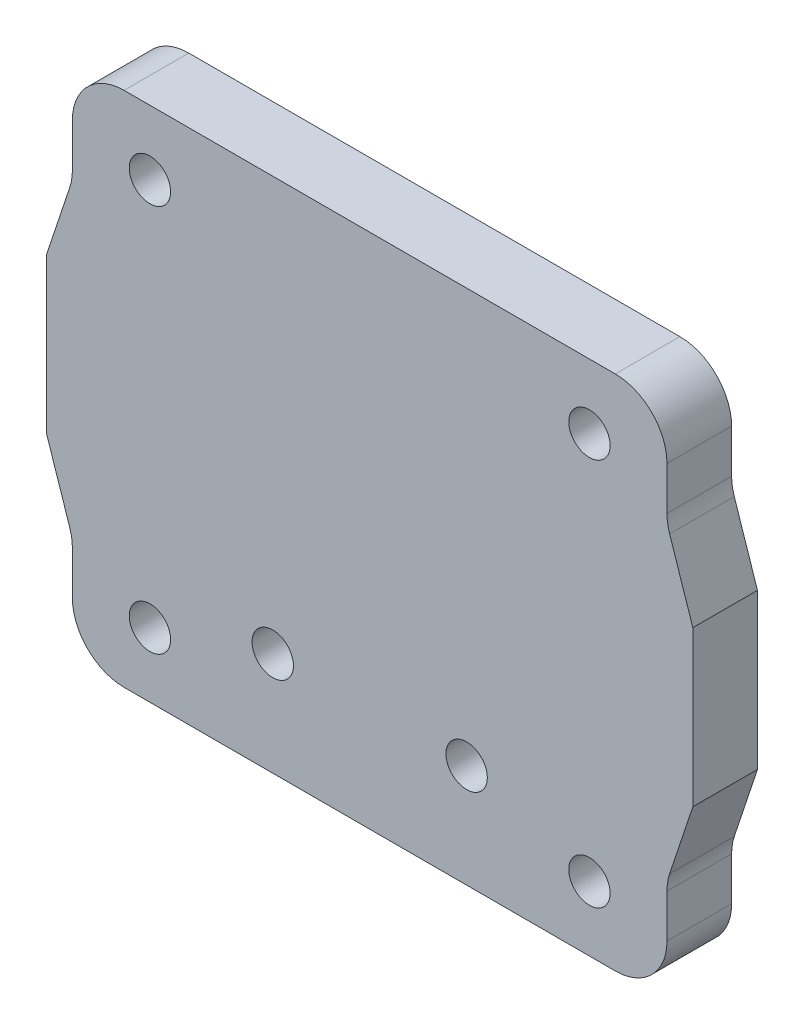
ISO-10303-21;
HEADER;
FILE_DESCRIPTION(('STEP AP214'),'2;1');
FILE_NAME('part.step','',(''),(''),'','','');
FILE_SCHEMA(('AUTOMOTIVE_DESIGN { 1 0 10303 214 1 1 1 1 }'));
ENDSEC;
DATA;
#1=APPLICATION_CONTEXT('core data for automotive mechanical design processes');
#2=APPLICATION_PROTOCOL_DEFINITION('international standard','automotive_design',2000,#1);
#3=PRODUCT_CONTEXT('',#1,'mechanical');
#4=PRODUCT('Part','Part','',(#3));
#5=PRODUCT_RELATED_PRODUCT_CATEGORY('part','',(#4));
#6=PRODUCT_DEFINITION_FORMATION('','',#4);
#7=PRODUCT_DEFINITION_CONTEXT('part definition',#1,'design');
#8=PRODUCT_DEFINITION('design','',#6,#7);
#9=PRODUCT_DEFINITION_SHAPE('','',#8);
#10=(LENGTH_UNIT() NAMED_UNIT(*) SI_UNIT(.MILLI.,.METRE.));
#11=(NAMED_UNIT(*) PLANE_ANGLE_UNIT() SI_UNIT($,.RADIAN.));
#12=(NAMED_UNIT(*) SI_UNIT($,.STERADIAN.) SOLID_ANGLE_UNIT());
#13=UNCERTAINTY_MEASURE_WITH_UNIT(LENGTH_MEASURE(1.E-05),#10,'distance_accuracy_value','');
#14=(GEOMETRIC_REPRESENTATION_CONTEXT(3) GLOBAL_UNCERTAINTY_ASSIGNED_CONTEXT((#13)) GLOBAL_UNIT_ASSIGNED_CONTEXT((#10,
#11,#12)) REPRESENTATION_CONTEXT('',''));
#15=CARTESIAN_POINT('',(0.,0.,0.));
#16=DIRECTION('',(0.,0.,1.));
#17=DIRECTION('',(1.,0.,0.));
#18=AXIS2_PLACEMENT_3D('',#15,#16,#17);
#19=CARTESIAN_POINT('',(-23.,20.,5.));
#20=DIRECTION('',(1.,0.,0.));
#21=DIRECTION('',(0.,1.,0.));
#22=AXIS2_PLACEMENT_3D('',#19,#20,#21);
#23=PLANE('',#22);
#24=DIRECTION('',(0.,-1.,0.));
#25=VECTOR('',#24,1.);
#26=CARTESIAN_POINT('',(-23.,20.,0.));
#27=LINE('',#26,#25);
#28=CARTESIAN_POINT('',(-23.,-12.6491106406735,0.));
#29=VERTEX_POINT('',#28);
#30=CARTESIAN_POINT('',(-23.,-16.,0.));
#31=VERTEX_POINT('',#30);
#32=EDGE_CURVE('E249',#29,#31,#27,.T.);
#33=ORIENTED_EDGE('',*,*,#32,.T.);
#34=DIRECTION('',(0.,0.,-1.));
#35=VECTOR('',#34,1.);
#36=CARTESIAN_POINT('',(-23.,-16.,5.));
#37=LINE('',#36,#35);
#38=CARTESIAN_POINT('',(-23.,-16.,5.));
#39=VERTEX_POINT('',#38);
#40=EDGE_CURVE('E290',#31,#39,#37,.F.);
#41=ORIENTED_EDGE('',*,*,#40,.T.);
#42=DIRECTION('',(0.,-1.,0.));
#43=VECTOR('',#42,1.);
#44=CARTESIAN_POINT('',(-23.,20.,5.));
#45=LINE('',#44,#43);
#46=CARTESIAN_POINT('',(-23.,-12.6491106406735,5.));
#47=VERTEX_POINT('',#46);
#48=EDGE_CURVE('E237',#47,#39,#45,.T.);
#49=ORIENTED_EDGE('',*,*,#48,.F.);
#50=DIRECTION('',(0.,0.,1.));
#51=VECTOR('',#50,1.);
#52=CARTESIAN_POINT('',(-23.,-12.6491106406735,5.));
#53=LINE('',#52,#51);
#54=EDGE_CURVE('E288',#47,#29,#53,.F.);
#55=ORIENTED_EDGE('',*,*,#54,.T.);
#56=EDGE_LOOP('',(#33,#41,#49,#55));
#57=FACE_BOUND('',#56,.T.);
#58=ADVANCED_FACE('F33',(#57),#23,.F.);
#59=CARTESIAN_POINT('',(23.,20.,5.));
#60=DIRECTION('',(-1.,0.,0.));
#61=DIRECTION('',(0.,-1.,0.));
#62=AXIS2_PLACEMENT_3D('',#59,#60,#61);
#63=PLANE('',#62);
#64=DIRECTION('',(0.,1.,0.));
#65=VECTOR('',#64,1.);
#66=CARTESIAN_POINT('',(23.,20.,0.));
#67=LINE('',#66,#65);
#68=CARTESIAN_POINT('',(23.,12.6491106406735,0.));
#69=VERTEX_POINT('',#68);
#70=CARTESIAN_POINT('',(23.,16.,0.));
#71=VERTEX_POINT('',#70);
#72=EDGE_CURVE('E227',#69,#71,#67,.T.);
#73=ORIENTED_EDGE('',*,*,#72,.T.);
#74=DIRECTION('',(0.,0.,-1.));
#75=VECTOR('',#74,1.);
#76=CARTESIAN_POINT('',(23.,16.,5.));
#77=LINE('',#76,#75);
#78=CARTESIAN_POINT('',(23.,16.,5.));
#79=VERTEX_POINT('',#78);
#80=EDGE_CURVE('E269',#71,#79,#77,.F.);
#81=ORIENTED_EDGE('',*,*,#80,.T.);
#82=DIRECTION('',(0.,1.,0.));
#83=VECTOR('',#82,1.);
#84=CARTESIAN_POINT('',(23.,20.,5.));
#85=LINE('',#84,#83);
#86=CARTESIAN_POINT('',(23.,12.6491106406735,5.));
#87=VERTEX_POINT('',#86);
#88=EDGE_CURVE('E234',#87,#79,#85,.T.);
#89=ORIENTED_EDGE('',*,*,#88,.F.);
#90=DIRECTION('',(0.,0.,1.));
#91=VECTOR('',#90,1.);
#92=CARTESIAN_POINT('',(23.,12.6491106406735,5.));
#93=LINE('',#92,#91);
#94=EDGE_CURVE('E267',#87,#69,#93,.F.);
#95=ORIENTED_EDGE('',*,*,#94,.T.);
#96=EDGE_LOOP('',(#73,#81,#89,#95));
#97=FACE_BOUND('',#96,.T.);
#98=ADVANCED_FACE('F356',(#97),#63,.F.);
#99=CARTESIAN_POINT('',(23.,-16.,5.));
#100=VERTEX_POINT('',#99);
#101=CARTESIAN_POINT('',(23.,-12.6491106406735,5.));
#102=VERTEX_POINT('',#101);
#103=EDGE_CURVE('E230',#100,#102,#85,.T.);
#104=ORIENTED_EDGE('',*,*,#103,.F.);
#105=DIRECTION('',(0.,0.,-1.));
#106=VECTOR('',#105,1.);
#107=CARTESIAN_POINT('',(23.,-16.,5.));
#108=LINE('',#107,#106);
#109=CARTESIAN_POINT('',(23.,-16.,0.));
#110=VERTEX_POINT('',#109);
#111=EDGE_CURVE('E295',#100,#110,#108,.T.);
#112=ORIENTED_EDGE('',*,*,#111,.T.);
#113=CARTESIAN_POINT('',(23.,-12.6491106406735,0.));
#114=VERTEX_POINT('',#113);
#115=EDGE_CURVE('E245',#110,#114,#67,.T.);
#116=ORIENTED_EDGE('',*,*,#115,.T.);
#117=DIRECTION('',(0.,0.,1.));
#118=VECTOR('',#117,1.);
#119=CARTESIAN_POINT('',(23.,-12.6491106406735,5.));
#120=LINE('',#119,#118);
#121=EDGE_CURVE('E292',#114,#102,#120,.T.);
#122=ORIENTED_EDGE('',*,*,#121,.T.);
#123=EDGE_LOOP('',(#104,#112,#116,#122));
#124=FACE_BOUND('',#123,.T.);
#125=ADVANCED_FACE('F382',(#124),#63,.F.);
#126=CARTESIAN_POINT('',(-23.,20.,5.));
#127=DIRECTION('',(0.,-1.,0.));
#128=DIRECTION('',(0.,0.,-1.));
#129=AXIS2_PLACEMENT_3D('',#126,#127,#128);
#130=PLANE('',#129);
#131=DIRECTION('',(-1.,0.,0.));
#132=VECTOR('',#131,1.);
#133=CARTESIAN_POINT('',(-23.,20.,5.));
#134=LINE('',#133,#132);
#135=CARTESIAN_POINT('',(19.,20.,5.));
#136=VERTEX_POINT('',#135);
#137=CARTESIAN_POINT('',(-19.,20.,5.));
#138=VERTEX_POINT('',#137);
#139=EDGE_CURVE('E233',#136,#138,#134,.T.);
#140=ORIENTED_EDGE('',*,*,#139,.F.);
#141=DIRECTION('',(0.,0.,-1.));
#142=VECTOR('',#141,1.);
#143=CARTESIAN_POINT('',(19.,20.,5.));
#144=LINE('',#143,#142);
#145=CARTESIAN_POINT('',(19.,20.,0.));
#146=VERTEX_POINT('',#145);
#147=EDGE_CURVE('E256',#136,#146,#144,.T.);
#148=ORIENTED_EDGE('',*,*,#147,.T.);
#149=DIRECTION('',(-1.,0.,0.));
#150=VECTOR('',#149,1.);
#151=CARTESIAN_POINT('',(-23.,20.,0.));
#152=LINE('',#151,#150);
#153=CARTESIAN_POINT('',(-19.,20.,0.));
#154=VERTEX_POINT('',#153);
#155=EDGE_CURVE('E246',#146,#154,#152,.T.);
#156=ORIENTED_EDGE('',*,*,#155,.T.);
#157=DIRECTION('',(0.,0.,-1.));
#158=VECTOR('',#157,1.);
#159=CARTESIAN_POINT('',(-19.,20.,5.));
#160=LINE('',#159,#158);
#161=EDGE_CURVE('E242',#154,#138,#160,.F.);
#162=ORIENTED_EDGE('',*,*,#161,.T.);
#163=EDGE_LOOP('',(#140,#148,#156,#162));
#164=FACE_BOUND('',#163,.T.);
#165=ADVANCED_FACE('F347',(#164),#130,.F.);
#166=CARTESIAN_POINT('',(-23.,16.,5.));
#167=VERTEX_POINT('',#166);
#168=CARTESIAN_POINT('',(-23.,12.6491106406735,5.));
#169=VERTEX_POINT('',#168);
#170=EDGE_CURVE('E239',#167,#169,#45,.T.);
#171=ORIENTED_EDGE('',*,*,#170,.F.);
#172=DIRECTION('',(0.,0.,-1.));
#173=VECTOR('',#172,1.);
#174=CARTESIAN_POINT('',(-23.,16.,5.));
#175=LINE('',#174,#173);
#176=CARTESIAN_POINT('',(-23.,16.,0.));
#177=VERTEX_POINT('',#176);
#178=EDGE_CURVE('E281',#167,#177,#175,.T.);
#179=ORIENTED_EDGE('',*,*,#178,.T.);
#180=CARTESIAN_POINT('',(-23.,12.6491106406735,0.));
#181=VERTEX_POINT('',#180);
#182=EDGE_CURVE('E250',#177,#181,#27,.T.);
#183=ORIENTED_EDGE('',*,*,#182,.T.);
#184=DIRECTION('',(0.,0.,1.));
#185=VECTOR('',#184,1.);
#186=CARTESIAN_POINT('',(-23.,12.6491106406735,5.));
#187=LINE('',#186,#185);
#188=EDGE_CURVE('E278',#181,#169,#187,.T.);
#189=ORIENTED_EDGE('',*,*,#188,.T.);
#190=EDGE_LOOP('',(#171,#179,#183,#189));
#191=FACE_BOUND('',#190,.T.);
#192=ADVANCED_FACE('F339',(#191),#23,.F.);
#193=CARTESIAN_POINT('',(-23.,-20.,5.));
#194=DIRECTION('',(0.,1.,0.));
#195=DIRECTION('',(0.,0.,1.));
#196=AXIS2_PLACEMENT_3D('',#193,#194,#195);
#197=PLANE('',#196);
#198=DIRECTION('',(1.,0.,0.));
#199=VECTOR('',#198,1.);
#200=CARTESIAN_POINT('',(-23.,-20.,5.));
#201=LINE('',#200,#199);
#202=CARTESIAN_POINT('',(-19.,-20.,5.));
#203=VERTEX_POINT('',#202);
#204=CARTESIAN_POINT('',(19.,-20.,5.));
#205=VERTEX_POINT('',#204);
#206=EDGE_CURVE('E240',#203,#205,#201,.T.);
#207=ORIENTED_EDGE('',*,*,#206,.F.);
#208=DIRECTION('',(0.,0.,-1.));
#209=VECTOR('',#208,1.);
#210=CARTESIAN_POINT('',(-19.,-20.,5.));
#211=LINE('',#210,#209);
#212=CARTESIAN_POINT('',(-19.,-20.,0.));
#213=VERTEX_POINT('',#212);
#214=EDGE_CURVE('E285',#203,#213,#211,.T.);
#215=ORIENTED_EDGE('',*,*,#214,.T.);
#216=DIRECTION('',(1.,0.,0.));
#217=VECTOR('',#216,1.);
#218=CARTESIAN_POINT('',(-23.,-20.,0.));
#219=LINE('',#218,#217);
#220=CARTESIAN_POINT('',(19.,-20.,0.));
#221=VERTEX_POINT('',#220);
#222=EDGE_CURVE('E253',#213,#221,#219,.T.);
#223=ORIENTED_EDGE('',*,*,#222,.T.);
#224=DIRECTION('',(0.,0.,-1.));
#225=VECTOR('',#224,1.);
#226=CARTESIAN_POINT('',(19.,-20.,5.));
#227=LINE('',#226,#225);
#228=EDGE_CURVE('E48',#221,#205,#227,.F.);
#229=ORIENTED_EDGE('',*,*,#228,.T.);
#230=EDGE_LOOP('',(#207,#215,#223,#229));
#231=FACE_BOUND('',#230,.T.);
#232=ADVANCED_FACE('F389',(#231),#197,.F.);
#233=CARTESIAN_POINT('',(0.,0.,5.));
#234=DIRECTION('',(0.,0.,1.));
#235=DIRECTION('',(1.,0.,0.));
#236=AXIS2_PLACEMENT_3D('',#233,#234,#235);
#237=PLANE('',#236);
#238=CARTESIAN_POINT('',(17.,15.,5.));
#239=DIRECTION('',(0.,0.,1.));
#240=DIRECTION('',(1.,0.,0.));
#241=AXIS2_PLACEMENT_3D('',#238,#239,#240);
#242=CIRCLE('',#241,1.6);
#243=CARTESIAN_POINT('',(18.6,15.,5.));
#244=VERTEX_POINT('',#243);
#245=EDGE_CURVE('E488',#244,#244,#242,.T.);
#246=ORIENTED_EDGE('',*,*,#245,.F.);
#247=EDGE_LOOP('',(#246));
#248=FACE_BOUND('',#247,.T.);
#249=CARTESIAN_POINT('',(17.,-15.,5.));
#250=DIRECTION('',(0.,0.,1.));
#251=DIRECTION('',(1.,0.,0.));
#252=AXIS2_PLACEMENT_3D('',#249,#250,#251);
#253=CIRCLE('',#252,1.6);
#254=CARTESIAN_POINT('',(18.6,-15.,5.));
#255=VERTEX_POINT('',#254);
#256=EDGE_CURVE('E484',#255,#255,#253,.T.);
#257=ORIENTED_EDGE('',*,*,#256,.F.);
#258=EDGE_LOOP('',(#257));
#259=FACE_BOUND('',#258,.T.);
#260=CARTESIAN_POINT('',(-17.,-15.,5.));
#261=DIRECTION('',(0.,0.,1.));
#262=DIRECTION('',(1.,0.,0.));
#263=AXIS2_PLACEMENT_3D('',#260,#261,#262);
#264=CIRCLE('',#263,1.6);
#265=CARTESIAN_POINT('',(-15.4,-15.,5.));
#266=VERTEX_POINT('',#265);
#267=EDGE_CURVE('E480',#266,#266,#264,.T.);
#268=ORIENTED_EDGE('',*,*,#267,.F.);
#269=EDGE_LOOP('',(#268));
#270=FACE_BOUND('',#269,.T.);
#271=CARTESIAN_POINT('',(-7.5,-12.,5.));
#272=DIRECTION('',(0.,0.,1.));
#273=DIRECTION('',(1.,0.,0.));
#274=AXIS2_PLACEMENT_3D('',#271,#272,#273);
#275=CIRCLE('',#274,1.6);
#276=CARTESIAN_POINT('',(-5.9,-12.,5.));
#277=VERTEX_POINT('',#276);
#278=EDGE_CURVE('E476',#277,#277,#275,.T.);
#279=ORIENTED_EDGE('',*,*,#278,.F.);
#280=EDGE_LOOP('',(#279));
#281=FACE_BOUND('',#280,.T.);
#282=CARTESIAN_POINT('',(7.5,-12.,5.));
#283=DIRECTION('',(0.,0.,1.));
#284=DIRECTION('',(1.,0.,0.));
#285=AXIS2_PLACEMENT_3D('',#282,#283,#284);
#286=CIRCLE('',#285,1.6);
#287=CARTESIAN_POINT('',(9.1,-12.,5.));
#288=VERTEX_POINT('',#287);
#289=EDGE_CURVE('E472',#288,#288,#286,.T.);
#290=ORIENTED_EDGE('',*,*,#289,.F.);
#291=EDGE_LOOP('',(#290));
#292=FACE_BOUND('',#291,.T.);
#293=CARTESIAN_POINT('',(-17.,15.,5.));
#294=DIRECTION('',(0.,0.,1.));
#295=DIRECTION('',(1.,0.,0.));
#296=AXIS2_PLACEMENT_3D('',#293,#294,#295);
#297=CIRCLE('',#296,1.6);
#298=CARTESIAN_POINT('',(-15.4,15.,5.));
#299=VERTEX_POINT('',#298);
#300=EDGE_CURVE('E468',#299,#299,#297,.T.);
#301=ORIENTED_EDGE('',*,*,#300,.F.);
#302=EDGE_LOOP('',(#301));
#303=FACE_BOUND('',#302,.T.);
#304=ORIENTED_EDGE('',*,*,#88,.T.);
#305=CARTESIAN_POINT('',(19.,16.,5.));
#306=DIRECTION('',(0.,0.,1.));
#307=DIRECTION('',(1.,0.,0.));
#308=AXIS2_PLACEMENT_3D('',#305,#306,#307);
#309=CIRCLE('',#308,4.);
#310=EDGE_CURVE('E276',#79,#136,#309,.T.);
#311=ORIENTED_EDGE('',*,*,#310,.T.);
#312=ORIENTED_EDGE('',*,*,#139,.T.);
#313=CARTESIAN_POINT('',(-19.,16.,5.));
#314=DIRECTION('',(0.,0.,1.));
#315=DIRECTION('',(1.,0.,0.));
#316=AXIS2_PLACEMENT_3D('',#313,#314,#315);
#317=CIRCLE('',#316,4.);
#318=EDGE_CURVE('E274',#138,#167,#317,.T.);
#319=ORIENTED_EDGE('',*,*,#318,.T.);
#320=ORIENTED_EDGE('',*,*,#170,.T.);
#321=CARTESIAN_POINT('',(-27.,12.6491106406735,5.));
#322=DIRECTION('',(0.,0.,1.));
#323=DIRECTION('',(1.,0.,0.));
#324=AXIS2_PLACEMENT_3D('',#321,#322,#323);
#325=CIRCLE('',#324,4.);
#326=CARTESIAN_POINT('',(-23.2052668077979,11.3841995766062,5.));
#327=VERTEX_POINT('',#326);
#328=EDGE_CURVE('E315',#169,#327,#325,.F.);
#329=ORIENTED_EDGE('',*,*,#328,.T.);
#330=DIRECTION('',(-0.316227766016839,-0.948683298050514,0.));
#331=VECTOR('',#330,1.);
#332=CARTESIAN_POINT('',(-25.,6.,5.));
#333=LINE('',#332,#331);
#334=CARTESIAN_POINT('',(-25.,6.,5.));
#335=VERTEX_POINT('',#334);
#336=EDGE_CURVE('E201',#327,#335,#333,.T.);
#337=ORIENTED_EDGE('',*,*,#336,.T.);
#338=DIRECTION('',(0.,-1.,0.));
#339=VECTOR('',#338,1.);
#340=CARTESIAN_POINT('',(-25.,-6.,5.));
#341=LINE('',#340,#339);
#342=CARTESIAN_POINT('',(-25.,-6.,5.));
#343=VERTEX_POINT('',#342);
#344=EDGE_CURVE('E189',#335,#343,#341,.T.);
#345=ORIENTED_EDGE('',*,*,#344,.T.);
#346=DIRECTION('',(0.316227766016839,-0.948683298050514,0.));
#347=VECTOR('',#346,1.);
#348=CARTESIAN_POINT('',(-25.,-6.,5.));
#349=LINE('',#348,#347);
#350=CARTESIAN_POINT('',(-23.2052668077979,-11.3841995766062,5.));
#351=VERTEX_POINT('',#350);
#352=EDGE_CURVE('E183',#343,#351,#349,.T.);
#353=ORIENTED_EDGE('',*,*,#352,.T.);
#354=CARTESIAN_POINT('',(-27.,-12.6491106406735,5.));
#355=DIRECTION('',(0.,0.,1.));
#356=DIRECTION('',(1.,0.,0.));
#357=AXIS2_PLACEMENT_3D('',#354,#355,#356);
#358=CIRCLE('',#357,4.);
#359=EDGE_CURVE('E41',#351,#47,#358,.F.);
#360=ORIENTED_EDGE('',*,*,#359,.T.);
#361=ORIENTED_EDGE('',*,*,#48,.T.);
#362=CARTESIAN_POINT('',(-19.,-16.,5.));
#363=DIRECTION('',(0.,0.,1.));
#364=DIRECTION('',(1.,0.,0.));
#365=AXIS2_PLACEMENT_3D('',#362,#363,#364);
#366=CIRCLE('',#365,4.);
#367=EDGE_CURVE('E55',#39,#203,#366,.T.);
#368=ORIENTED_EDGE('',*,*,#367,.T.);
#369=ORIENTED_EDGE('',*,*,#206,.T.);
#370=CARTESIAN_POINT('',(19.,-16.,5.));
#371=DIRECTION('',(0.,0.,1.));
#372=DIRECTION('',(1.,0.,0.));
#373=AXIS2_PLACEMENT_3D('',#370,#371,#372);
#374=CIRCLE('',#373,4.);
#375=EDGE_CURVE('E271',#205,#100,#374,.T.);
#376=ORIENTED_EDGE('',*,*,#375,.T.);
#377=ORIENTED_EDGE('',*,*,#103,.T.);
#378=CARTESIAN_POINT('',(27.,-12.6491106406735,5.));
#379=DIRECTION('',(0.,0.,1.));
#380=DIRECTION('',(1.,0.,0.));
#381=AXIS2_PLACEMENT_3D('',#378,#379,#380);
#382=CIRCLE('',#381,4.);
#383=CARTESIAN_POINT('',(23.205266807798,-11.3841995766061,5.));
#384=VERTEX_POINT('',#383);
#385=EDGE_CURVE('E311',#102,#384,#382,.F.);
#386=ORIENTED_EDGE('',*,*,#385,.T.);
#387=DIRECTION('',(0.316227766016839,0.948683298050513,0.));
#388=VECTOR('',#387,1.);
#389=CARTESIAN_POINT('',(25.,-6.00000000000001,5.));
#390=LINE('',#389,#388);
#391=CARTESIAN_POINT('',(25.,-6.00000000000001,5.));
#392=VERTEX_POINT('',#391);
#393=EDGE_CURVE('E221',#384,#392,#390,.T.);
#394=ORIENTED_EDGE('',*,*,#393,.T.);
#395=DIRECTION('',(0.,1.,0.));
#396=VECTOR('',#395,1.);
#397=CARTESIAN_POINT('',(25.,-6.00000000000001,5.));
#398=LINE('',#397,#396);
#399=CARTESIAN_POINT('',(25.,5.99999999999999,5.));
#400=VERTEX_POINT('',#399);
#401=EDGE_CURVE('E213',#392,#400,#398,.T.);
#402=ORIENTED_EDGE('',*,*,#401,.T.);
#403=DIRECTION('',(-0.316227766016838,0.948683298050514,0.));
#404=VECTOR('',#403,1.);
#405=CARTESIAN_POINT('',(25.,5.99999999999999,5.));
#406=LINE('',#405,#404);
#407=CARTESIAN_POINT('',(23.2052668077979,11.3841995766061,5.));
#408=VERTEX_POINT('',#407);
#409=EDGE_CURVE('E207',#400,#408,#406,.T.);
#410=ORIENTED_EDGE('',*,*,#409,.T.);
#411=CARTESIAN_POINT('',(27.,12.6491106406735,5.));
#412=DIRECTION('',(0.,0.,1.));
#413=DIRECTION('',(1.,0.,0.));
#414=AXIS2_PLACEMENT_3D('',#411,#412,#413);
#415=CIRCLE('',#414,4.);
#416=EDGE_CURVE('E307',#408,#87,#415,.F.);
#417=ORIENTED_EDGE('',*,*,#416,.T.);
#418=EDGE_LOOP('',(#304,#311,#312,#319,#320,#329,#337,#345,#353,#360,#361,#368,#369,#376,#377,
#386,#394,#402,#410,#417));
#419=FACE_BOUND('',#418,.T.);
#420=ADVANCED_FACE('F320',(#248,#259,#270,#281,#292,#303,#419),#237,.T.);
#421=CARTESIAN_POINT('',(0.,0.,0.));
#422=DIRECTION('',(0.,0.,1.));
#423=DIRECTION('',(1.,0.,0.));
#424=AXIS2_PLACEMENT_3D('',#421,#422,#423);
#425=PLANE('',#424);
#426=CARTESIAN_POINT('',(17.,15.,0.));
#427=DIRECTION('',(0.,0.,1.));
#428=DIRECTION('',(1.,0.,0.));
#429=AXIS2_PLACEMENT_3D('',#426,#427,#428);
#430=CIRCLE('',#429,1.6);
#431=CARTESIAN_POINT('',(18.6,15.,0.));
#432=VERTEX_POINT('',#431);
#433=EDGE_CURVE('E448',#432,#432,#430,.T.);
#434=ORIENTED_EDGE('',*,*,#433,.T.);
#435=EDGE_LOOP('',(#434));
#436=FACE_BOUND('',#435,.T.);
#437=CARTESIAN_POINT('',(17.,-15.,0.));
#438=DIRECTION('',(0.,0.,1.));
#439=DIRECTION('',(1.,0.,0.));
#440=AXIS2_PLACEMENT_3D('',#437,#438,#439);
#441=CIRCLE('',#440,1.6);
#442=CARTESIAN_POINT('',(18.6,-15.,0.));
#443=VERTEX_POINT('',#442);
#444=EDGE_CURVE('E452',#443,#443,#441,.T.);
#445=ORIENTED_EDGE('',*,*,#444,.T.);
#446=EDGE_LOOP('',(#445));
#447=FACE_BOUND('',#446,.T.);
#448=CARTESIAN_POINT('',(-17.,-15.,0.));
#449=DIRECTION('',(0.,0.,1.));
#450=DIRECTION('',(1.,0.,0.));
#451=AXIS2_PLACEMENT_3D('',#448,#449,#450);
#452=CIRCLE('',#451,1.6);
#453=CARTESIAN_POINT('',(-15.4,-15.,0.));
#454=VERTEX_POINT('',#453);
#455=EDGE_CURVE('E456',#454,#454,#452,.T.);
#456=ORIENTED_EDGE('',*,*,#455,.T.);
#457=EDGE_LOOP('',(#456));
#458=FACE_BOUND('',#457,.T.);
#459=CARTESIAN_POINT('',(-7.5,-12.,0.));
#460=DIRECTION('',(0.,0.,1.));
#461=DIRECTION('',(1.,0.,0.));
#462=AXIS2_PLACEMENT_3D('',#459,#460,#461);
#463=CIRCLE('',#462,1.6);
#464=CARTESIAN_POINT('',(-5.9,-12.,0.));
#465=VERTEX_POINT('',#464);
#466=EDGE_CURVE('E460',#465,#465,#463,.T.);
#467=ORIENTED_EDGE('',*,*,#466,.T.);
#468=EDGE_LOOP('',(#467));
#469=FACE_BOUND('',#468,.T.);
#470=CARTESIAN_POINT('',(7.5,-12.,0.));
#471=DIRECTION('',(0.,0.,1.));
#472=DIRECTION('',(1.,0.,0.));
#473=AXIS2_PLACEMENT_3D('',#470,#471,#472);
#474=CIRCLE('',#473,1.6);
#475=CARTESIAN_POINT('',(9.1,-12.,0.));
#476=VERTEX_POINT('',#475);
#477=EDGE_CURVE('E464',#476,#476,#474,.T.);
#478=ORIENTED_EDGE('',*,*,#477,.T.);
#479=EDGE_LOOP('',(#478));
#480=FACE_BOUND('',#479,.T.);
#481=CARTESIAN_POINT('',(-17.,15.,0.));
#482=DIRECTION('',(0.,0.,1.));
#483=DIRECTION('',(1.,0.,0.));
#484=AXIS2_PLACEMENT_3D('',#481,#482,#483);
#485=CIRCLE('',#484,1.6);
#486=CARTESIAN_POINT('',(-15.4,15.,0.));
#487=VERTEX_POINT('',#486);
#488=EDGE_CURVE('E203',#487,#487,#485,.T.);
#489=ORIENTED_EDGE('',*,*,#488,.T.);
#490=EDGE_LOOP('',(#489));
#491=FACE_BOUND('',#490,.T.);
#492=ORIENTED_EDGE('',*,*,#155,.F.);
#493=CARTESIAN_POINT('',(19.,16.,0.));
#494=DIRECTION('',(0.,0.,1.));
#495=DIRECTION('',(1.,0.,0.));
#496=AXIS2_PLACEMENT_3D('',#493,#494,#495);
#497=CIRCLE('',#496,4.);
#498=EDGE_CURVE('E265',#146,#71,#497,.F.);
#499=ORIENTED_EDGE('',*,*,#498,.T.);
#500=ORIENTED_EDGE('',*,*,#72,.F.);
#501=CARTESIAN_POINT('',(27.,12.6491106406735,0.));
#502=DIRECTION('',(0.,0.,1.));
#503=DIRECTION('',(1.,0.,0.));
#504=AXIS2_PLACEMENT_3D('',#501,#502,#503);
#505=CIRCLE('',#504,4.);
#506=CARTESIAN_POINT('',(23.2052668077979,11.3841995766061,0.));
#507=VERTEX_POINT('',#506);
#508=EDGE_CURVE('E309',#69,#507,#505,.T.);
#509=ORIENTED_EDGE('',*,*,#508,.T.);
#510=DIRECTION('',(-0.316227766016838,0.948683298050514,0.));
#511=VECTOR('',#510,1.);
#512=CARTESIAN_POINT('',(25.,5.99999999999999,0.));
#513=LINE('',#512,#511);
#514=CARTESIAN_POINT('',(25.,5.99999999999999,0.));
#515=VERTEX_POINT('',#514);
#516=EDGE_CURVE('E209',#515,#507,#513,.T.);
#517=ORIENTED_EDGE('',*,*,#516,.F.);
#518=DIRECTION('',(0.,1.,0.));
#519=VECTOR('',#518,1.);
#520=CARTESIAN_POINT('',(25.,-6.00000000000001,0.));
#521=LINE('',#520,#519);
#522=CARTESIAN_POINT('',(25.,-6.00000000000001,0.));
#523=VERTEX_POINT('',#522);
#524=EDGE_CURVE('E215',#523,#515,#521,.T.);
#525=ORIENTED_EDGE('',*,*,#524,.F.);
#526=DIRECTION('',(0.316227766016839,0.948683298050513,0.));
#527=VECTOR('',#526,1.);
#528=CARTESIAN_POINT('',(25.,-6.00000000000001,0.));
#529=LINE('',#528,#527);
#530=CARTESIAN_POINT('',(23.205266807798,-11.3841995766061,0.));
#531=VERTEX_POINT('',#530);
#532=EDGE_CURVE('E212',#531,#523,#529,.T.);
#533=ORIENTED_EDGE('',*,*,#532,.F.);
#534=CARTESIAN_POINT('',(27.,-12.6491106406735,0.));
#535=DIRECTION('',(0.,0.,1.));
#536=DIRECTION('',(1.,0.,0.));
#537=AXIS2_PLACEMENT_3D('',#534,#535,#536);
#538=CIRCLE('',#537,4.);
#539=EDGE_CURVE('E313',#531,#114,#538,.T.);
#540=ORIENTED_EDGE('',*,*,#539,.T.);
#541=ORIENTED_EDGE('',*,*,#115,.F.);
#542=CARTESIAN_POINT('',(19.,-16.,0.));
#543=DIRECTION('',(0.,0.,1.));
#544=DIRECTION('',(1.,0.,0.));
#545=AXIS2_PLACEMENT_3D('',#542,#543,#544);
#546=CIRCLE('',#545,4.);
#547=EDGE_CURVE('E259',#110,#221,#546,.F.);
#548=ORIENTED_EDGE('',*,*,#547,.T.);
#549=ORIENTED_EDGE('',*,*,#222,.F.);
#550=CARTESIAN_POINT('',(-19.,-16.,0.));
#551=DIRECTION('',(0.,0.,1.));
#552=DIRECTION('',(1.,0.,0.));
#553=AXIS2_PLACEMENT_3D('',#550,#551,#552);
#554=CIRCLE('',#553,4.);
#555=EDGE_CURVE('E261',#213,#31,#554,.F.);
#556=ORIENTED_EDGE('',*,*,#555,.T.);
#557=ORIENTED_EDGE('',*,*,#32,.F.);
#558=CARTESIAN_POINT('',(-27.,-12.6491106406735,0.));
#559=DIRECTION('',(0.,0.,1.));
#560=DIRECTION('',(1.,0.,0.));
#561=AXIS2_PLACEMENT_3D('',#558,#559,#560);
#562=CIRCLE('',#561,4.);
#563=CARTESIAN_POINT('',(-23.2052668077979,-11.3841995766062,0.));
#564=VERTEX_POINT('',#563);
#565=EDGE_CURVE('E11',#29,#564,#562,.T.);
#566=ORIENTED_EDGE('',*,*,#565,.T.);
#567=DIRECTION('',(0.316227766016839,-0.948683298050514,0.));
#568=VECTOR('',#567,1.);
#569=CARTESIAN_POINT('',(-25.,-6.,0.));
#570=LINE('',#569,#568);
#571=CARTESIAN_POINT('',(-25.,-6.,0.));
#572=VERTEX_POINT('',#571);
#573=EDGE_CURVE('E191',#572,#564,#570,.T.);
#574=ORIENTED_EDGE('',*,*,#573,.F.);
#575=DIRECTION('',(0.,-1.,0.));
#576=VECTOR('',#575,1.);
#577=CARTESIAN_POINT('',(-25.,-6.,0.));
#578=LINE('',#577,#576);
#579=CARTESIAN_POINT('',(-25.,6.,0.));
#580=VERTEX_POINT('',#579);
#581=EDGE_CURVE('E182',#580,#572,#578,.T.);
#582=ORIENTED_EDGE('',*,*,#581,.F.);
#583=DIRECTION('',(-0.316227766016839,-0.948683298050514,0.));
#584=VECTOR('',#583,1.);
#585=CARTESIAN_POINT('',(-25.,6.,0.));
#586=LINE('',#585,#584);
#587=CARTESIAN_POINT('',(-23.2052668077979,11.3841995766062,0.));
#588=VERTEX_POINT('',#587);
#589=EDGE_CURVE('E171',#588,#580,#586,.T.);
#590=ORIENTED_EDGE('',*,*,#589,.F.);
#591=CARTESIAN_POINT('',(-27.,12.6491106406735,0.));
#592=DIRECTION('',(0.,0.,1.));
#593=DIRECTION('',(1.,0.,0.));
#594=AXIS2_PLACEMENT_3D('',#591,#592,#593);
#595=CIRCLE('',#594,4.);
#596=EDGE_CURVE('E317',#588,#181,#595,.T.);
#597=ORIENTED_EDGE('',*,*,#596,.T.);
#598=ORIENTED_EDGE('',*,*,#182,.F.);
#599=CARTESIAN_POINT('',(-19.,16.,0.));
#600=DIRECTION('',(0.,0.,1.));
#601=DIRECTION('',(1.,0.,0.));
#602=AXIS2_PLACEMENT_3D('',#599,#600,#601);
#603=CIRCLE('',#602,4.);
#604=EDGE_CURVE('E263',#177,#154,#603,.F.);
#605=ORIENTED_EDGE('',*,*,#604,.T.);
#606=EDGE_LOOP('',(#492,#499,#500,#509,#517,#525,#533,#540,#541,#548,#549,#556,#557,#566,#574,
#582,#590,#597,#598,#605));
#607=FACE_BOUND('',#606,.T.);
#608=ADVANCED_FACE('F195',(#436,#447,#458,#469,#480,#491,#607),#425,.F.);
#609=CARTESIAN_POINT('',(25.,5.99999999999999,0.));
#610=DIRECTION('',(0.948683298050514,0.316227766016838,0.));
#611=DIRECTION('',(-0.316227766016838,0.948683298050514,0.));
#612=AXIS2_PLACEMENT_3D('',#609,#610,#611);
#613=PLANE('',#612);
#614=ORIENTED_EDGE('',*,*,#516,.T.);
#615=DIRECTION('',(0.,0.,1.));
#616=VECTOR('',#615,1.);
#617=CARTESIAN_POINT('',(23.2052668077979,11.3841995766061,0.));
#618=LINE('',#617,#616);
#619=EDGE_CURVE('E298',#507,#408,#618,.T.);
#620=ORIENTED_EDGE('',*,*,#619,.T.);
#621=ORIENTED_EDGE('',*,*,#409,.F.);
#622=DIRECTION('',(0.,0.,1.));
#623=VECTOR('',#622,1.);
#624=CARTESIAN_POINT('',(25.,5.99999999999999,0.));
#625=LINE('',#624,#623);
#626=EDGE_CURVE('E225',#515,#400,#625,.T.);
#627=ORIENTED_EDGE('',*,*,#626,.F.);
#628=EDGE_LOOP('',(#614,#620,#621,#627));
#629=FACE_BOUND('',#628,.T.);
#630=ADVANCED_FACE('F365',(#629),#613,.T.);
#631=CARTESIAN_POINT('',(25.,-6.00000000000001,0.));
#632=DIRECTION('',(1.,0.,0.));
#633=DIRECTION('',(0.,0.,-1.));
#634=AXIS2_PLACEMENT_3D('',#631,#632,#633);
#635=PLANE('',#634);
#636=ORIENTED_EDGE('',*,*,#401,.F.);
#637=DIRECTION('',(0.,0.,1.));
#638=VECTOR('',#637,1.);
#639=CARTESIAN_POINT('',(25.,-6.00000000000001,0.));
#640=LINE('',#639,#638);
#641=EDGE_CURVE('E218',#523,#392,#640,.T.);
#642=ORIENTED_EDGE('',*,*,#641,.F.);
#643=ORIENTED_EDGE('',*,*,#524,.T.);
#644=ORIENTED_EDGE('',*,*,#626,.T.);
#645=EDGE_LOOP('',(#636,#642,#643,#644));
#646=FACE_BOUND('',#645,.T.);
#647=ADVANCED_FACE('F369',(#646),#635,.T.);
#648=CARTESIAN_POINT('',(25.,-6.00000000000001,0.));
#649=DIRECTION('',(0.948683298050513,-0.316227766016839,0.));
#650=DIRECTION('',(0.316227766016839,0.948683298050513,0.));
#651=AXIS2_PLACEMENT_3D('',#648,#649,#650);
#652=PLANE('',#651);
#653=ORIENTED_EDGE('',*,*,#393,.F.);
#654=DIRECTION('',(0.,0.,1.));
#655=VECTOR('',#654,1.);
#656=CARTESIAN_POINT('',(23.205266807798,-11.3841995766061,0.));
#657=LINE('',#656,#655);
#658=EDGE_CURVE('E301',#384,#531,#657,.F.);
#659=ORIENTED_EDGE('',*,*,#658,.T.);
#660=ORIENTED_EDGE('',*,*,#532,.T.);
#661=ORIENTED_EDGE('',*,*,#641,.T.);
#662=EDGE_LOOP('',(#653,#659,#660,#661));
#663=FACE_BOUND('',#662,.T.);
#664=ADVANCED_FACE('F431',(#663),#652,.T.);
#665=CARTESIAN_POINT('',(-25.,6.,0.));
#666=DIRECTION('',(-0.948683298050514,0.316227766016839,0.));
#667=DIRECTION('',(-0.316227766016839,-0.948683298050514,0.));
#668=AXIS2_PLACEMENT_3D('',#665,#666,#667);
#669=PLANE('',#668);
#670=ORIENTED_EDGE('',*,*,#336,.F.);
#671=DIRECTION('',(0.,0.,1.));
#672=VECTOR('',#671,1.);
#673=CARTESIAN_POINT('',(-23.2052668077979,11.3841995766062,0.));
#674=LINE('',#673,#672);
#675=EDGE_CURVE('E178',#327,#588,#674,.F.);
#676=ORIENTED_EDGE('',*,*,#675,.T.);
#677=ORIENTED_EDGE('',*,*,#589,.T.);
#678=DIRECTION('',(0.,0.,1.));
#679=VECTOR('',#678,1.);
#680=CARTESIAN_POINT('',(-25.,6.,0.));
#681=LINE('',#680,#679);
#682=EDGE_CURVE('E175',#580,#335,#681,.T.);
#683=ORIENTED_EDGE('',*,*,#682,.T.);
#684=EDGE_LOOP('',(#670,#676,#677,#683));
#685=FACE_BOUND('',#684,.T.);
#686=ADVANCED_FACE('F174',(#685),#669,.T.);
#687=CARTESIAN_POINT('',(-25.,-6.,0.));
#688=DIRECTION('',(-0.948683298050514,-0.316227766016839,0.));
#689=DIRECTION('',(0.316227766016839,-0.948683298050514,0.));
#690=AXIS2_PLACEMENT_3D('',#687,#688,#689);
#691=PLANE('',#690);
#692=ORIENTED_EDGE('',*,*,#573,.T.);
#693=DIRECTION('',(0.,0.,1.));
#694=VECTOR('',#693,1.);
#695=CARTESIAN_POINT('',(-23.2052668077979,-11.3841995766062,0.));
#696=LINE('',#695,#694);
#697=EDGE_CURVE('E304',#564,#351,#696,.T.);
#698=ORIENTED_EDGE('',*,*,#697,.T.);
#699=ORIENTED_EDGE('',*,*,#352,.F.);
#700=DIRECTION('',(0.,0.,1.));
#701=VECTOR('',#700,1.);
#702=CARTESIAN_POINT('',(-25.,-6.,0.));
#703=LINE('',#702,#701);
#704=EDGE_CURVE('E190',#572,#343,#703,.T.);
#705=ORIENTED_EDGE('',*,*,#704,.F.);
#706=EDGE_LOOP('',(#692,#698,#699,#705));
#707=FACE_BOUND('',#706,.T.);
#708=ADVANCED_FACE('F331',(#707),#691,.T.);
#709=CARTESIAN_POINT('',(-25.,-6.,0.));
#710=DIRECTION('',(-1.,0.,0.));
#711=DIRECTION('',(0.,0.,1.));
#712=AXIS2_PLACEMENT_3D('',#709,#710,#711);
#713=PLANE('',#712);
#714=ORIENTED_EDGE('',*,*,#344,.F.);
#715=ORIENTED_EDGE('',*,*,#682,.F.);
#716=ORIENTED_EDGE('',*,*,#581,.T.);
#717=ORIENTED_EDGE('',*,*,#704,.T.);
#718=EDGE_LOOP('',(#714,#715,#716,#717));
#719=FACE_BOUND('',#718,.T.);
#720=ADVANCED_FACE('F187',(#719),#713,.T.);
#721=CARTESIAN_POINT('',(19.,16.,5.));
#722=DIRECTION('',(0.,0.,-1.));
#723=DIRECTION('',(-1.,0.,0.));
#724=AXIS2_PLACEMENT_3D('',#721,#722,#723);
#725=CYLINDRICAL_SURFACE('',#724,4.);
#726=ORIENTED_EDGE('',*,*,#310,.F.);
#727=ORIENTED_EDGE('',*,*,#80,.F.);
#728=ORIENTED_EDGE('',*,*,#498,.F.);
#729=ORIENTED_EDGE('',*,*,#147,.F.);
#730=EDGE_LOOP('',(#726,#727,#728,#729));
#731=FACE_BOUND('',#730,.T.);
#732=ADVANCED_FACE('F351',(#731),#725,.T.);
#733=CARTESIAN_POINT('',(-19.,16.,5.));
#734=DIRECTION('',(0.,0.,-1.));
#735=DIRECTION('',(-1.,0.,0.));
#736=AXIS2_PLACEMENT_3D('',#733,#734,#735);
#737=CYLINDRICAL_SURFACE('',#736,4.);
#738=ORIENTED_EDGE('',*,*,#318,.F.);
#739=ORIENTED_EDGE('',*,*,#161,.F.);
#740=ORIENTED_EDGE('',*,*,#604,.F.);
#741=ORIENTED_EDGE('',*,*,#178,.F.);
#742=EDGE_LOOP('',(#738,#739,#740,#741));
#743=FACE_BOUND('',#742,.T.);
#744=ADVANCED_FACE('F343',(#743),#737,.T.);
#745=CARTESIAN_POINT('',(-19.,-16.,5.));
#746=DIRECTION('',(0.,0.,-1.));
#747=DIRECTION('',(-1.,0.,0.));
#748=AXIS2_PLACEMENT_3D('',#745,#746,#747);
#749=CYLINDRICAL_SURFACE('',#748,4.);
#750=ORIENTED_EDGE('',*,*,#367,.F.);
#751=ORIENTED_EDGE('',*,*,#40,.F.);
#752=ORIENTED_EDGE('',*,*,#555,.F.);
#753=ORIENTED_EDGE('',*,*,#214,.F.);
#754=EDGE_LOOP('',(#750,#751,#752,#753));
#755=FACE_BOUND('',#754,.T.);
#756=ADVANCED_FACE('F392',(#755),#749,.T.);
#757=CARTESIAN_POINT('',(19.,-16.,5.));
#758=DIRECTION('',(0.,0.,-1.));
#759=DIRECTION('',(-1.,0.,0.));
#760=AXIS2_PLACEMENT_3D('',#757,#758,#759);
#761=CYLINDRICAL_SURFACE('',#760,4.);
#762=ORIENTED_EDGE('',*,*,#375,.F.);
#763=ORIENTED_EDGE('',*,*,#228,.F.);
#764=ORIENTED_EDGE('',*,*,#547,.F.);
#765=ORIENTED_EDGE('',*,*,#111,.F.);
#766=EDGE_LOOP('',(#762,#763,#764,#765));
#767=FACE_BOUND('',#766,.T.);
#768=ADVANCED_FACE('F387',(#767),#761,.T.);
#769=CARTESIAN_POINT('',(27.,12.6491106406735,0.));
#770=DIRECTION('',(0.,0.,1.));
#771=DIRECTION('',(1.,0.,0.));
#772=AXIS2_PLACEMENT_3D('',#769,#770,#771);
#773=CYLINDRICAL_SURFACE('',#772,4.);
#774=ORIENTED_EDGE('',*,*,#508,.F.);
#775=ORIENTED_EDGE('',*,*,#94,.F.);
#776=ORIENTED_EDGE('',*,*,#416,.F.);
#777=ORIENTED_EDGE('',*,*,#619,.F.);
#778=EDGE_LOOP('',(#774,#775,#776,#777));
#779=FACE_BOUND('',#778,.T.);
#780=ADVANCED_FACE('F360',(#779),#773,.F.);
#781=CARTESIAN_POINT('',(27.,-12.6491106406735,5.));
#782=DIRECTION('',(0.,0.,1.));
#783=DIRECTION('',(1.,0.,0.));
#784=AXIS2_PLACEMENT_3D('',#781,#782,#783);
#785=CYLINDRICAL_SURFACE('',#784,4.);
#786=ORIENTED_EDGE('',*,*,#539,.F.);
#787=ORIENTED_EDGE('',*,*,#658,.F.);
#788=ORIENTED_EDGE('',*,*,#385,.F.);
#789=ORIENTED_EDGE('',*,*,#121,.F.);
#790=EDGE_LOOP('',(#786,#787,#788,#789));
#791=FACE_BOUND('',#790,.T.);
#792=ADVANCED_FACE('F379',(#791),#785,.F.);
#793=CARTESIAN_POINT('',(-27.,12.6491106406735,5.));
#794=DIRECTION('',(0.,0.,1.));
#795=DIRECTION('',(1.,0.,0.));
#796=AXIS2_PLACEMENT_3D('',#793,#794,#795);
#797=CYLINDRICAL_SURFACE('',#796,4.);
#798=ORIENTED_EDGE('',*,*,#596,.F.);
#799=ORIENTED_EDGE('',*,*,#675,.F.);
#800=ORIENTED_EDGE('',*,*,#328,.F.);
#801=ORIENTED_EDGE('',*,*,#188,.F.);
#802=EDGE_LOOP('',(#798,#799,#800,#801));
#803=FACE_BOUND('',#802,.T.);
#804=ADVANCED_FACE('F334',(#803),#797,.F.);
#805=CARTESIAN_POINT('',(-27.,-12.6491106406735,0.));
#806=DIRECTION('',(0.,0.,1.));
#807=DIRECTION('',(1.,0.,0.));
#808=AXIS2_PLACEMENT_3D('',#805,#806,#807);
#809=CYLINDRICAL_SURFACE('',#808,4.);
#810=ORIENTED_EDGE('',*,*,#565,.F.);
#811=ORIENTED_EDGE('',*,*,#54,.F.);
#812=ORIENTED_EDGE('',*,*,#359,.F.);
#813=ORIENTED_EDGE('',*,*,#697,.F.);
#814=EDGE_LOOP('',(#810,#811,#812,#813));
#815=FACE_BOUND('',#814,.T.);
#816=ADVANCED_FACE('F35',(#815),#809,.F.);
#817=CARTESIAN_POINT('',(-17.,15.,0.));
#818=DIRECTION('',(0.,0.,1.));
#819=DIRECTION('',(1.,0.,0.));
#820=AXIS2_PLACEMENT_3D('',#817,#818,#819);
#821=CYLINDRICAL_SURFACE('',#820,1.6);
#822=ORIENTED_EDGE('',*,*,#488,.F.);
#823=EDGE_LOOP('',(#822));
#824=FACE_BOUND('',#823,.T.);
#825=ORIENTED_EDGE('',*,*,#300,.T.);
#826=EDGE_LOOP('',(#825));
#827=FACE_BOUND('',#826,.T.);
#828=ADVANCED_FACE('F505',(#824,#827),#821,.F.);
#829=CARTESIAN_POINT('',(7.5,-12.,0.));
#830=DIRECTION('',(0.,0.,1.));
#831=DIRECTION('',(1.,0.,0.));
#832=AXIS2_PLACEMENT_3D('',#829,#830,#831);
#833=CYLINDRICAL_SURFACE('',#832,1.6);
#834=ORIENTED_EDGE('',*,*,#477,.F.);
#835=EDGE_LOOP('',(#834));
#836=FACE_BOUND('',#835,.T.);
#837=ORIENTED_EDGE('',*,*,#289,.T.);
#838=EDGE_LOOP('',(#837));
#839=FACE_BOUND('',#838,.T.);
#840=ADVANCED_FACE('F507',(#836,#839),#833,.F.);
#841=CARTESIAN_POINT('',(-7.5,-12.,0.));
#842=DIRECTION('',(0.,0.,1.));
#843=DIRECTION('',(1.,0.,0.));
#844=AXIS2_PLACEMENT_3D('',#841,#842,#843);
#845=CYLINDRICAL_SURFACE('',#844,1.6);
#846=ORIENTED_EDGE('',*,*,#466,.F.);
#847=EDGE_LOOP('',(#846));
#848=FACE_BOUND('',#847,.T.);
#849=ORIENTED_EDGE('',*,*,#278,.T.);
#850=EDGE_LOOP('',(#849));
#851=FACE_BOUND('',#850,.T.);
#852=ADVANCED_FACE('F512',(#848,#851),#845,.F.);
#853=CARTESIAN_POINT('',(-17.,-15.,0.));
#854=DIRECTION('',(0.,0.,1.));
#855=DIRECTION('',(1.,0.,0.));
#856=AXIS2_PLACEMENT_3D('',#853,#854,#855);
#857=CYLINDRICAL_SURFACE('',#856,1.6);
#858=ORIENTED_EDGE('',*,*,#455,.F.);
#859=EDGE_LOOP('',(#858));
#860=FACE_BOUND('',#859,.T.);
#861=ORIENTED_EDGE('',*,*,#267,.T.);
#862=EDGE_LOOP('',(#861));
#863=FACE_BOUND('',#862,.T.);
#864=ADVANCED_FACE('F518',(#860,#863),#857,.F.);
#865=CARTESIAN_POINT('',(17.,-15.,0.));
#866=DIRECTION('',(0.,0.,1.));
#867=DIRECTION('',(1.,0.,0.));
#868=AXIS2_PLACEMENT_3D('',#865,#866,#867);
#869=CYLINDRICAL_SURFACE('',#868,1.6);
#870=ORIENTED_EDGE('',*,*,#444,.F.);
#871=EDGE_LOOP('',(#870));
#872=FACE_BOUND('',#871,.T.);
#873=ORIENTED_EDGE('',*,*,#256,.T.);
#874=EDGE_LOOP('',(#873));
#875=FACE_BOUND('',#874,.T.);
#876=ADVANCED_FACE('F522',(#872,#875),#869,.F.);
#877=CARTESIAN_POINT('',(17.,15.,0.));
#878=DIRECTION('',(0.,0.,1.));
#879=DIRECTION('',(1.,0.,0.));
#880=AXIS2_PLACEMENT_3D('',#877,#878,#879);
#881=CYLINDRICAL_SURFACE('',#880,1.6);
#882=ORIENTED_EDGE('',*,*,#433,.F.);
#883=EDGE_LOOP('',(#882));
#884=FACE_BOUND('',#883,.T.);
#885=ORIENTED_EDGE('',*,*,#245,.T.);
#886=EDGE_LOOP('',(#885));
#887=FACE_BOUND('',#886,.T.);
#888=ADVANCED_FACE('F493',(#884,#887),#881,.F.);
#889=CLOSED_SHELL('',(#58,#98,#125,#165,#192,#232,#420,#608,#630,#647,#664,#686,#708,#720,#732,
#744,#756,#768,#780,#792,#804,#816,#828,#840,#852,#864,#876,#888));
#890=MANIFOLD_SOLID_BREP('B2',#889);
#891=ADVANCED_BREP_SHAPE_REPRESENTATION('',(#18,#890),#14);
#892=SHAPE_DEFINITION_REPRESENTATION(#9,#891);
ENDSEC;
END-ISO-10303-21;
